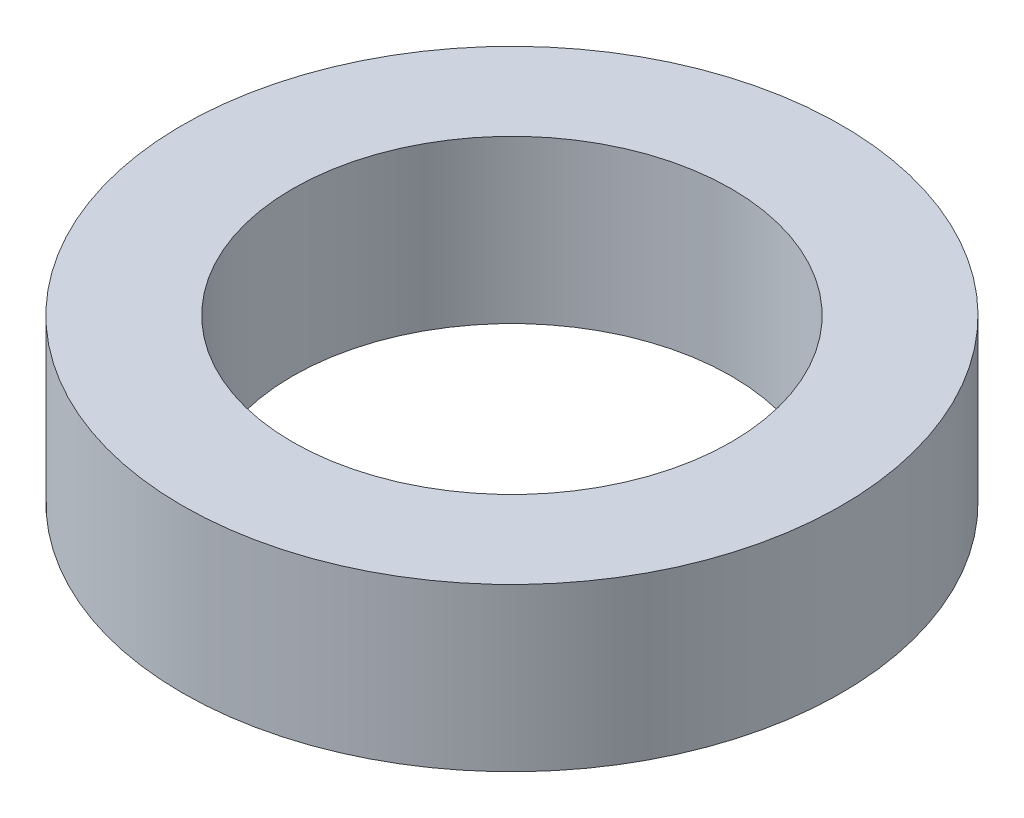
ISO-10303-21;
HEADER;
FILE_DESCRIPTION(('STEP AP214'),'2;1');
FILE_NAME('part.step','',(''),(''),'','','');
FILE_SCHEMA(('AUTOMOTIVE_DESIGN { 1 0 10303 214 1 1 1 1 }'));
ENDSEC;
DATA;
#1=APPLICATION_CONTEXT('core data for automotive mechanical design processes');
#2=APPLICATION_PROTOCOL_DEFINITION('international standard','automotive_design',2000,#1);
#3=PRODUCT_CONTEXT('',#1,'mechanical');
#4=PRODUCT('Part','Part','',(#3));
#5=PRODUCT_RELATED_PRODUCT_CATEGORY('part','',(#4));
#6=PRODUCT_DEFINITION_FORMATION('','',#4);
#7=PRODUCT_DEFINITION_CONTEXT('part definition',#1,'design');
#8=PRODUCT_DEFINITION('design','',#6,#7);
#9=PRODUCT_DEFINITION_SHAPE('','',#8);
#10=(LENGTH_UNIT() NAMED_UNIT(*) SI_UNIT(.MILLI.,.METRE.));
#11=(NAMED_UNIT(*) PLANE_ANGLE_UNIT() SI_UNIT($,.RADIAN.));
#12=(NAMED_UNIT(*) SI_UNIT($,.STERADIAN.) SOLID_ANGLE_UNIT());
#13=UNCERTAINTY_MEASURE_WITH_UNIT(LENGTH_MEASURE(1.E-05),#10,'distance_accuracy_value','');
#14=(GEOMETRIC_REPRESENTATION_CONTEXT(3) GLOBAL_UNCERTAINTY_ASSIGNED_CONTEXT((#13)) GLOBAL_UNIT_ASSIGNED_CONTEXT((#10,
#11,#12)) REPRESENTATION_CONTEXT('',''));
#15=CARTESIAN_POINT('',(0.,0.,0.));
#16=DIRECTION('',(0.,0.,1.));
#17=DIRECTION('',(1.,0.,0.));
#18=AXIS2_PLACEMENT_3D('',#15,#16,#17);
#19=CARTESIAN_POINT('',(0.,1.,0.));
#20=DIRECTION('',(0.,-1.,0.));
#21=DIRECTION('',(0.,0.,-1.));
#22=AXIS2_PLACEMENT_3D('',#19,#20,#21);
#23=CYLINDRICAL_SURFACE('',#22,2.032);
#24=CARTESIAN_POINT('',(0.,1.,0.));
#25=DIRECTION('',(0.,1.,0.));
#26=DIRECTION('',(0.,0.,1.));
#27=AXIS2_PLACEMENT_3D('',#24,#25,#26);
#28=CIRCLE('',#27,2.032);
#29=CARTESIAN_POINT('',(0.,1.,2.032));
#30=VERTEX_POINT('',#29);
#31=EDGE_CURVE('E10',#30,#30,#28,.T.);
#32=ORIENTED_EDGE('',*,*,#31,.F.);
#33=EDGE_LOOP('',(#32));
#34=FACE_BOUND('',#33,.T.);
#35=CARTESIAN_POINT('',(0.,0.,0.));
#36=DIRECTION('',(0.,1.,0.));
#37=DIRECTION('',(0.,0.,1.));
#38=AXIS2_PLACEMENT_3D('',#35,#36,#37);
#39=CIRCLE('',#38,2.032);
#40=CARTESIAN_POINT('',(0.,0.,2.032));
#41=VERTEX_POINT('',#40);
#42=EDGE_CURVE('E36',#41,#41,#39,.T.);
#43=ORIENTED_EDGE('',*,*,#42,.T.);
#44=EDGE_LOOP('',(#43));
#45=FACE_BOUND('',#44,.T.);
#46=ADVANCED_FACE('F33',(#34,#45),#23,.T.);
#47=CARTESIAN_POINT('',(0.,1.,0.));
#48=DIRECTION('',(0.,1.,0.));
#49=DIRECTION('',(0.,0.,1.));
#50=AXIS2_PLACEMENT_3D('',#47,#48,#49);
#51=PLANE('',#50);
#52=CARTESIAN_POINT('',(0.,1.,0.));
#53=DIRECTION('',(0.,1.,0.));
#54=DIRECTION('',(0.,0.,1.));
#55=AXIS2_PLACEMENT_3D('',#52,#53,#54);
#56=CIRCLE('',#55,1.35255);
#57=CARTESIAN_POINT('',(0.,1.,1.35255));
#58=VERTEX_POINT('',#57);
#59=EDGE_CURVE('E47',#58,#58,#56,.T.);
#60=ORIENTED_EDGE('',*,*,#59,.F.);
#61=EDGE_LOOP('',(#60));
#62=FACE_BOUND('',#61,.T.);
#63=ORIENTED_EDGE('',*,*,#31,.T.);
#64=EDGE_LOOP('',(#63));
#65=FACE_BOUND('',#64,.T.);
#66=ADVANCED_FACE('F53',(#62,#65),#51,.T.);
#67=CARTESIAN_POINT('',(0.,0.,0.));
#68=DIRECTION('',(0.,1.,0.));
#69=DIRECTION('',(0.,0.,1.));
#70=AXIS2_PLACEMENT_3D('',#67,#68,#69);
#71=PLANE('',#70);
#72=CARTESIAN_POINT('',(0.,0.,0.));
#73=DIRECTION('',(0.,1.,0.));
#74=DIRECTION('',(0.,0.,1.));
#75=AXIS2_PLACEMENT_3D('',#72,#73,#74);
#76=CIRCLE('',#75,1.35255);
#77=CARTESIAN_POINT('',(0.,0.,1.35255));
#78=VERTEX_POINT('',#77);
#79=EDGE_CURVE('E43',#78,#78,#76,.T.);
#80=ORIENTED_EDGE('',*,*,#79,.T.);
#81=EDGE_LOOP('',(#80));
#82=FACE_BOUND('',#81,.T.);
#83=ORIENTED_EDGE('',*,*,#42,.F.);
#84=EDGE_LOOP('',(#83));
#85=FACE_BOUND('',#84,.T.);
#86=ADVANCED_FACE('F55',(#82,#85),#71,.F.);
#87=CARTESIAN_POINT('',(0.,1.,0.));
#88=DIRECTION('',(0.,1.,0.));
#89=DIRECTION('',(0.,0.,1.));
#90=AXIS2_PLACEMENT_3D('',#87,#88,#89);
#91=CYLINDRICAL_SURFACE('',#90,1.35255);
#92=ORIENTED_EDGE('',*,*,#79,.F.);
#93=EDGE_LOOP('',(#92));
#94=FACE_BOUND('',#93,.T.);
#95=ORIENTED_EDGE('',*,*,#59,.T.);
#96=EDGE_LOOP('',(#95));
#97=FACE_BOUND('',#96,.T.);
#98=ADVANCED_FACE('F51',(#94,#97),#91,.F.);
#99=CLOSED_SHELL('',(#46,#66,#86,#98));
#100=MANIFOLD_SOLID_BREP('B2',#99);
#101=ADVANCED_BREP_SHAPE_REPRESENTATION('',(#18,#100),#14);
#102=SHAPE_DEFINITION_REPRESENTATION(#9,#101);
ENDSEC;
END-ISO-10303-21;
